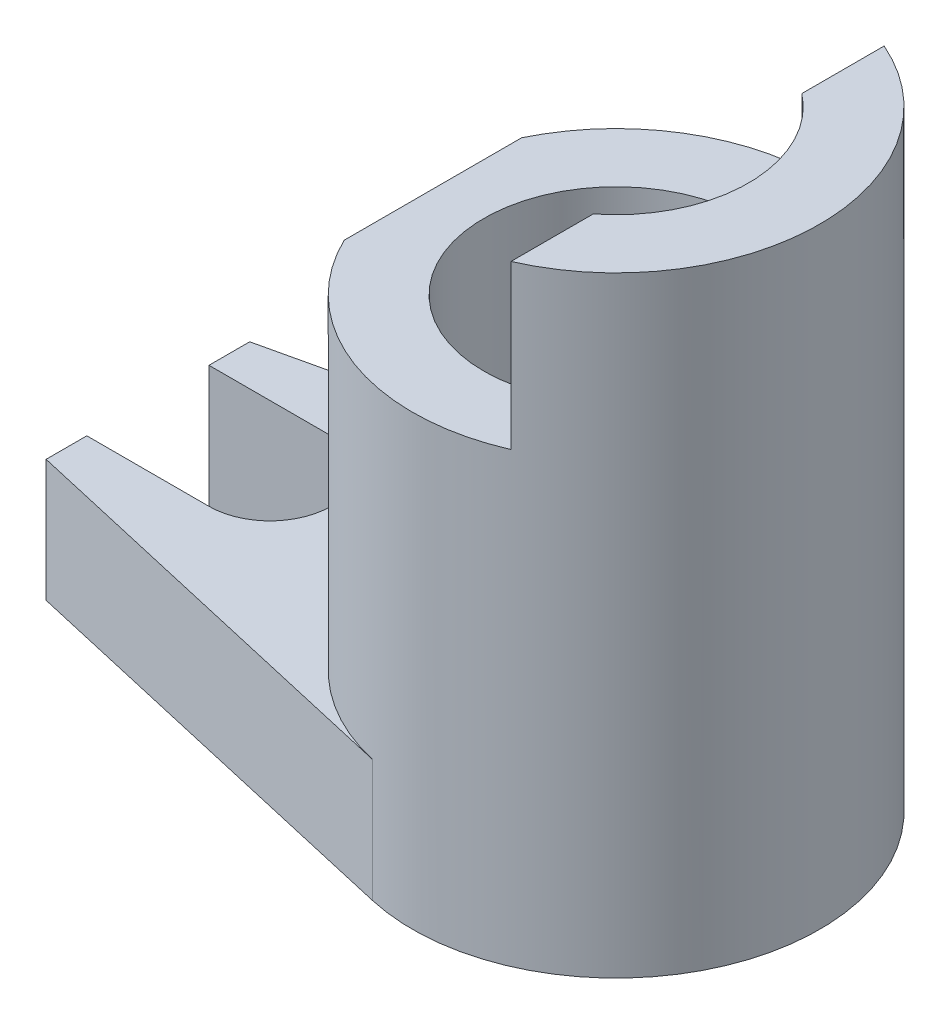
ISO-10303-21;
HEADER;
FILE_DESCRIPTION(('STEP AP214'),'2;1');
FILE_NAME('part.step','',(''),(''),'','','');
FILE_SCHEMA(('AUTOMOTIVE_DESIGN { 1 0 10303 214 1 1 1 1 }'));
ENDSEC;
DATA;
#1=APPLICATION_CONTEXT('core data for automotive mechanical design processes');
#2=APPLICATION_PROTOCOL_DEFINITION('international standard','automotive_design',2000,#1);
#3=PRODUCT_CONTEXT('',#1,'mechanical');
#4=PRODUCT('Part','Part','',(#3));
#5=PRODUCT_RELATED_PRODUCT_CATEGORY('part','',(#4));
#6=PRODUCT_DEFINITION_FORMATION('','',#4);
#7=PRODUCT_DEFINITION_CONTEXT('part definition',#1,'design');
#8=PRODUCT_DEFINITION('design','',#6,#7);
#9=PRODUCT_DEFINITION_SHAPE('','',#8);
#10=(LENGTH_UNIT() NAMED_UNIT(*) SI_UNIT(.MILLI.,.METRE.));
#11=(NAMED_UNIT(*) PLANE_ANGLE_UNIT() SI_UNIT($,.RADIAN.));
#12=(NAMED_UNIT(*) SI_UNIT($,.STERADIAN.) SOLID_ANGLE_UNIT());
#13=UNCERTAINTY_MEASURE_WITH_UNIT(LENGTH_MEASURE(1.E-05),#10,'distance_accuracy_value','');
#14=(GEOMETRIC_REPRESENTATION_CONTEXT(3) GLOBAL_UNCERTAINTY_ASSIGNED_CONTEXT((#13)) GLOBAL_UNIT_ASSIGNED_CONTEXT((#10,
#11,#12)) REPRESENTATION_CONTEXT('',''));
#15=CARTESIAN_POINT('',(0.,0.,0.));
#16=DIRECTION('',(0.,0.,1.));
#17=DIRECTION('',(1.,0.,0.));
#18=AXIS2_PLACEMENT_3D('',#15,#16,#17);
#19=CARTESIAN_POINT('',(-115.,30.,-25.));
#20=DIRECTION('',(1.,0.,0.));
#21=DIRECTION('',(0.,0.,-1.));
#22=AXIS2_PLACEMENT_3D('',#19,#20,#21);
#23=PLANE('',#22);
#24=DIRECTION('',(0.,0.,1.));
#25=VECTOR('',#24,1.);
#26=CARTESIAN_POINT('',(-115.,0.,-25.));
#27=LINE('',#26,#25);
#28=CARTESIAN_POINT('',(-115.,0.,-25.));
#29=VERTEX_POINT('',#28);
#30=CARTESIAN_POINT('',(-115.,0.,-15.));
#31=VERTEX_POINT('',#30);
#32=EDGE_CURVE('E281',#29,#31,#27,.T.);
#33=ORIENTED_EDGE('',*,*,#32,.T.);
#34=DIRECTION('',(0.,1.,0.));
#35=VECTOR('',#34,1.);
#36=CARTESIAN_POINT('',(-115.,0.,-15.));
#37=LINE('',#36,#35);
#38=CARTESIAN_POINT('',(-115.,30.,-15.));
#39=VERTEX_POINT('',#38);
#40=EDGE_CURVE('E278',#31,#39,#37,.T.);
#41=ORIENTED_EDGE('',*,*,#40,.T.);
#42=DIRECTION('',(0.,0.,1.));
#43=VECTOR('',#42,1.);
#44=CARTESIAN_POINT('',(-115.,30.,-25.));
#45=LINE('',#44,#43);
#46=CARTESIAN_POINT('',(-115.,30.,-25.));
#47=VERTEX_POINT('',#46);
#48=EDGE_CURVE('E195',#47,#39,#45,.T.);
#49=ORIENTED_EDGE('',*,*,#48,.F.);
#50=DIRECTION('',(0.,-1.,0.));
#51=VECTOR('',#50,1.);
#52=CARTESIAN_POINT('',(-115.,30.,-25.));
#53=LINE('',#52,#51);
#54=EDGE_CURVE('E178',#47,#29,#53,.T.);
#55=ORIENTED_EDGE('',*,*,#54,.T.);
#56=EDGE_LOOP('',(#33,#41,#49,#55));
#57=FACE_BOUND('',#56,.T.);
#58=ADVANCED_FACE('F31',(#57),#23,.F.);
#59=CARTESIAN_POINT('',(0.,30.,0.));
#60=DIRECTION('',(0.,-1.,0.));
#61=DIRECTION('',(0.,0.,-1.));
#62=AXIS2_PLACEMENT_3D('',#59,#60,#61);
#63=CYLINDRICAL_SURFACE('',#62,50.);
#64=CARTESIAN_POINT('',(0.,110.,0.));
#65=DIRECTION('',(0.,1.,0.));
#66=DIRECTION('',(0.,0.,1.));
#67=AXIS2_PLACEMENT_3D('',#64,#65,#66);
#68=CIRCLE('',#67,50.);
#69=CARTESIAN_POINT('',(-45.,110.,21.7944947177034));
#70=VERTEX_POINT('',#69);
#71=CARTESIAN_POINT('',(20.,110.,45.8257569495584));
#72=VERTEX_POINT('',#71);
#73=EDGE_CURVE('E149',#70,#72,#68,.T.);
#74=ORIENTED_EDGE('',*,*,#73,.F.);
#75=DIRECTION('',(0.,-1.,0.));
#76=VECTOR('',#75,1.);
#77=CARTESIAN_POINT('',(-45.,30.,21.7944947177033));
#78=LINE('',#77,#76);
#79=CARTESIAN_POINT('',(-45.,70.,21.7944947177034));
#80=VERTEX_POINT('',#79);
#81=EDGE_CURVE('E46',#70,#80,#78,.T.);
#82=ORIENTED_EDGE('',*,*,#81,.T.);
#83=CARTESIAN_POINT('',(0.,70.,0.));
#84=DIRECTION('',(0.,1.,0.));
#85=DIRECTION('',(0.,0.,1.));
#86=AXIS2_PLACEMENT_3D('',#83,#84,#85);
#87=CIRCLE('',#86,50.);
#88=CARTESIAN_POINT('',(-45.,70.,-21.7944947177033));
#89=VERTEX_POINT('',#88);
#90=EDGE_CURVE('E11',#89,#80,#87,.T.);
#91=ORIENTED_EDGE('',*,*,#90,.F.);
#92=DIRECTION('',(0.,-1.,0.));
#93=VECTOR('',#92,1.);
#94=CARTESIAN_POINT('',(-45.,30.,-21.7944947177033));
#95=LINE('',#94,#93);
#96=CARTESIAN_POINT('',(-45.,110.,-21.7944947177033));
#97=VERTEX_POINT('',#96);
#98=EDGE_CURVE('E131',#89,#97,#95,.F.);
#99=ORIENTED_EDGE('',*,*,#98,.T.);
#100=CARTESIAN_POINT('',(20.,110.,-45.8257569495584));
#101=VERTEX_POINT('',#100);
#102=EDGE_CURVE('E141',#101,#97,#68,.T.);
#103=ORIENTED_EDGE('',*,*,#102,.F.);
#104=DIRECTION('',(0.,-1.,0.));
#105=VECTOR('',#104,1.);
#106=CARTESIAN_POINT('',(20.,30.,-45.8257569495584));
#107=LINE('',#106,#105);
#108=CARTESIAN_POINT('',(20.,150.,-45.8257569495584));
#109=VERTEX_POINT('',#108);
#110=EDGE_CURVE('E148',#101,#109,#107,.F.);
#111=ORIENTED_EDGE('',*,*,#110,.T.);
#112=CARTESIAN_POINT('',(0.,150.,0.));
#113=DIRECTION('',(0.,1.,0.));
#114=DIRECTION('',(0.,0.,1.));
#115=AXIS2_PLACEMENT_3D('',#112,#113,#114);
#116=CIRCLE('',#115,50.);
#117=CARTESIAN_POINT('',(20.,150.,45.8257569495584));
#118=VERTEX_POINT('',#117);
#119=EDGE_CURVE('E166',#118,#109,#116,.T.);
#120=ORIENTED_EDGE('',*,*,#119,.F.);
#121=DIRECTION('',(0.,-1.,0.));
#122=VECTOR('',#121,1.);
#123=CARTESIAN_POINT('',(20.,30.,45.8257569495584));
#124=LINE('',#123,#122);
#125=EDGE_CURVE('E151',#118,#72,#124,.T.);
#126=ORIENTED_EDGE('',*,*,#125,.T.);
#127=EDGE_LOOP('',(#74,#82,#91,#99,#103,#111,#120,#126));
#128=FACE_BOUND('',#127,.T.);
#129=CARTESIAN_POINT('',(0.,0.,0.));
#130=DIRECTION('',(0.,1.,0.));
#131=DIRECTION('',(0.,0.,1.));
#132=AXIS2_PLACEMENT_3D('',#129,#130,#131);
#133=CIRCLE('',#132,50.);
#134=CARTESIAN_POINT('',(-11.1429261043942,0.,48.7425399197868));
#135=VERTEX_POINT('',#134);
#136=CARTESIAN_POINT('',(-11.1429261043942,0.,-48.7425399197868));
#137=VERTEX_POINT('',#136);
#138=EDGE_CURVE('E274',#135,#137,#133,.T.);
#139=ORIENTED_EDGE('',*,*,#138,.T.);
#140=DIRECTION('',(0.,-1.,0.));
#141=VECTOR('',#140,1.);
#142=CARTESIAN_POINT('',(-11.1429261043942,30.,-48.7425399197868));
#143=LINE('',#142,#141);
#144=CARTESIAN_POINT('',(-11.1429261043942,30.,-48.7425399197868));
#145=VERTEX_POINT('',#144);
#146=EDGE_CURVE('E180',#145,#137,#143,.T.);
#147=ORIENTED_EDGE('',*,*,#146,.F.);
#148=CARTESIAN_POINT('',(0.,30.,0.));
#149=DIRECTION('',(0.,1.,0.));
#150=DIRECTION('',(0.,0.,1.));
#151=AXIS2_PLACEMENT_3D('',#148,#149,#150);
#152=CIRCLE('',#151,50.);
#153=CARTESIAN_POINT('',(-11.1429261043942,30.,48.7425399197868));
#154=VERTEX_POINT('',#153);
#155=EDGE_CURVE('E163',#145,#154,#152,.T.);
#156=ORIENTED_EDGE('',*,*,#155,.T.);
#157=DIRECTION('',(0.,-1.,0.));
#158=VECTOR('',#157,1.);
#159=CARTESIAN_POINT('',(-11.1429261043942,30.,48.7425399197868));
#160=LINE('',#159,#158);
#161=EDGE_CURVE('E194',#154,#135,#160,.T.);
#162=ORIENTED_EDGE('',*,*,#161,.T.);
#163=EDGE_LOOP('',(#139,#147,#156,#162));
#164=FACE_BOUND('',#163,.T.);
#165=ADVANCED_FACE('F33',(#128,#164),#63,.T.);
#166=CARTESIAN_POINT('',(-11.1429261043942,30.,-48.7425399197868));
#167=DIRECTION('',(0.222858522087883,0.,0.974850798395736));
#168=DIRECTION('',(0.974850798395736,0.,-0.222858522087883));
#169=AXIS2_PLACEMENT_3D('',#166,#167,#168);
#170=PLANE('',#169);
#171=DIRECTION('',(-0.974850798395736,0.,0.222858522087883));
#172=VECTOR('',#171,1.);
#173=CARTESIAN_POINT('',(-11.1429261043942,0.,-48.7425399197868));
#174=LINE('',#173,#172);
#175=EDGE_CURVE('E277',#137,#29,#174,.T.);
#176=ORIENTED_EDGE('',*,*,#175,.T.);
#177=ORIENTED_EDGE('',*,*,#54,.F.);
#178=DIRECTION('',(-0.974850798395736,0.,0.222858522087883));
#179=VECTOR('',#178,1.);
#180=CARTESIAN_POINT('',(-11.1429261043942,30.,-48.7425399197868));
#181=LINE('',#180,#179);
#182=EDGE_CURVE('E186',#145,#47,#181,.T.);
#183=ORIENTED_EDGE('',*,*,#182,.F.);
#184=ORIENTED_EDGE('',*,*,#146,.T.);
#185=EDGE_LOOP('',(#176,#177,#183,#184));
#186=FACE_BOUND('',#185,.T.);
#187=ADVANCED_FACE('F247',(#186),#170,.F.);
#188=CARTESIAN_POINT('',(-115.,30.,15.));
#189=VERTEX_POINT('',#188);
#190=CARTESIAN_POINT('',(-115.,30.,25.));
#191=VERTEX_POINT('',#190);
#192=EDGE_CURVE('E188',#189,#191,#45,.T.);
#193=ORIENTED_EDGE('',*,*,#192,.F.);
#194=DIRECTION('',(0.,1.,0.));
#195=VECTOR('',#194,1.);
#196=CARTESIAN_POINT('',(-115.,0.,15.));
#197=LINE('',#196,#195);
#198=CARTESIAN_POINT('',(-115.,0.,15.));
#199=VERTEX_POINT('',#198);
#200=EDGE_CURVE('E263',#199,#189,#197,.T.);
#201=ORIENTED_EDGE('',*,*,#200,.F.);
#202=CARTESIAN_POINT('',(-115.,0.,25.));
#203=VERTEX_POINT('',#202);
#204=EDGE_CURVE('E280',#199,#203,#27,.T.);
#205=ORIENTED_EDGE('',*,*,#204,.T.);
#206=DIRECTION('',(0.,-1.,0.));
#207=VECTOR('',#206,1.);
#208=CARTESIAN_POINT('',(-115.,30.,25.));
#209=LINE('',#208,#207);
#210=EDGE_CURVE('E200',#191,#203,#209,.T.);
#211=ORIENTED_EDGE('',*,*,#210,.F.);
#212=EDGE_LOOP('',(#193,#201,#205,#211));
#213=FACE_BOUND('',#212,.T.);
#214=ADVANCED_FACE('F243',(#213),#23,.F.);
#215=CARTESIAN_POINT('',(-115.,30.,25.));
#216=DIRECTION('',(0.222858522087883,0.,-0.974850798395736));
#217=DIRECTION('',(-0.974850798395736,0.,-0.222858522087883));
#218=AXIS2_PLACEMENT_3D('',#215,#216,#217);
#219=PLANE('',#218);
#220=DIRECTION('',(0.974850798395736,0.,0.222858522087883));
#221=VECTOR('',#220,1.);
#222=CARTESIAN_POINT('',(-115.,0.,25.));
#223=LINE('',#222,#221);
#224=EDGE_CURVE('E189',#203,#135,#223,.T.);
#225=ORIENTED_EDGE('',*,*,#224,.T.);
#226=ORIENTED_EDGE('',*,*,#161,.F.);
#227=DIRECTION('',(0.974850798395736,0.,0.222858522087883));
#228=VECTOR('',#227,1.);
#229=CARTESIAN_POINT('',(-115.,30.,25.));
#230=LINE('',#229,#228);
#231=EDGE_CURVE('E192',#191,#154,#230,.T.);
#232=ORIENTED_EDGE('',*,*,#231,.F.);
#233=ORIENTED_EDGE('',*,*,#210,.T.);
#234=EDGE_LOOP('',(#225,#226,#232,#233));
#235=FACE_BOUND('',#234,.T.);
#236=ADVANCED_FACE('F251',(#235),#219,.F.);
#237=CARTESIAN_POINT('',(0.,30.,0.));
#238=DIRECTION('',(0.,1.,0.));
#239=DIRECTION('',(0.,0.,1.));
#240=AXIS2_PLACEMENT_3D('',#237,#238,#239);
#241=PLANE('',#240);
#242=ORIENTED_EDGE('',*,*,#155,.F.);
#243=ORIENTED_EDGE('',*,*,#182,.T.);
#244=ORIENTED_EDGE('',*,*,#48,.T.);
#245=DIRECTION('',(-1.,0.,0.));
#246=VECTOR('',#245,1.);
#247=CARTESIAN_POINT('',(-115.,30.,-15.));
#248=LINE('',#247,#246);
#249=CARTESIAN_POINT('',(-85.,30.,-15.));
#250=VERTEX_POINT('',#249);
#251=EDGE_CURVE('E308',#250,#39,#248,.T.);
#252=ORIENTED_EDGE('',*,*,#251,.F.);
#253=CARTESIAN_POINT('',(-85.,30.,0.));
#254=DIRECTION('',(0.,1.,0.));
#255=DIRECTION('',(0.,0.,1.));
#256=AXIS2_PLACEMENT_3D('',#253,#254,#255);
#257=CIRCLE('',#256,15.);
#258=CARTESIAN_POINT('',(-85.,30.,15.));
#259=VERTEX_POINT('',#258);
#260=EDGE_CURVE('E305',#259,#250,#257,.T.);
#261=ORIENTED_EDGE('',*,*,#260,.F.);
#262=DIRECTION('',(1.,0.,0.));
#263=VECTOR('',#262,1.);
#264=CARTESIAN_POINT('',(-115.,30.,15.));
#265=LINE('',#264,#263);
#266=EDGE_CURVE('E169',#189,#259,#265,.T.);
#267=ORIENTED_EDGE('',*,*,#266,.F.);
#268=ORIENTED_EDGE('',*,*,#192,.T.);
#269=ORIENTED_EDGE('',*,*,#231,.T.);
#270=EDGE_LOOP('',(#242,#243,#244,#252,#261,#267,#268,#269));
#271=FACE_BOUND('',#270,.T.);
#272=ADVANCED_FACE('F257',(#271),#241,.T.);
#273=CARTESIAN_POINT('',(0.,0.,0.));
#274=DIRECTION('',(0.,1.,0.));
#275=DIRECTION('',(0.,0.,1.));
#276=AXIS2_PLACEMENT_3D('',#273,#274,#275);
#277=PLANE('',#276);
#278=CARTESIAN_POINT('',(-85.,0.,0.));
#279=DIRECTION('',(0.,1.,0.));
#280=DIRECTION('',(0.,0.,1.));
#281=AXIS2_PLACEMENT_3D('',#278,#279,#280);
#282=CIRCLE('',#281,15.);
#283=CARTESIAN_POINT('',(-85.,0.,15.));
#284=VERTEX_POINT('',#283);
#285=CARTESIAN_POINT('',(-85.,0.,-15.));
#286=VERTEX_POINT('',#285);
#287=EDGE_CURVE('E298',#284,#286,#282,.T.);
#288=ORIENTED_EDGE('',*,*,#287,.T.);
#289=DIRECTION('',(-1.,0.,0.));
#290=VECTOR('',#289,1.);
#291=CARTESIAN_POINT('',(-115.,0.,-15.));
#292=LINE('',#291,#290);
#293=EDGE_CURVE('E296',#286,#31,#292,.T.);
#294=ORIENTED_EDGE('',*,*,#293,.T.);
#295=ORIENTED_EDGE('',*,*,#32,.F.);
#296=ORIENTED_EDGE('',*,*,#175,.F.);
#297=ORIENTED_EDGE('',*,*,#138,.F.);
#298=ORIENTED_EDGE('',*,*,#224,.F.);
#299=ORIENTED_EDGE('',*,*,#204,.F.);
#300=DIRECTION('',(1.,0.,0.));
#301=VECTOR('',#300,1.);
#302=CARTESIAN_POINT('',(-115.,0.,15.));
#303=LINE('',#302,#301);
#304=EDGE_CURVE('E173',#199,#284,#303,.T.);
#305=ORIENTED_EDGE('',*,*,#304,.T.);
#306=EDGE_LOOP('',(#288,#294,#295,#296,#297,#298,#299,#305));
#307=FACE_BOUND('',#306,.T.);
#308=ADVANCED_FACE('F293',(#307),#277,.F.);
#309=CARTESIAN_POINT('',(-115.,0.,-15.));
#310=DIRECTION('',(0.,0.,-1.));
#311=DIRECTION('',(-1.,0.,0.));
#312=AXIS2_PLACEMENT_3D('',#309,#310,#311);
#313=PLANE('',#312);
#314=ORIENTED_EDGE('',*,*,#251,.T.);
#315=ORIENTED_EDGE('',*,*,#40,.F.);
#316=ORIENTED_EDGE('',*,*,#293,.F.);
#317=DIRECTION('',(0.,1.,0.));
#318=VECTOR('',#317,1.);
#319=CARTESIAN_POINT('',(-85.,0.,-15.));
#320=LINE('',#319,#318);
#321=EDGE_CURVE('E311',#286,#250,#320,.T.);
#322=ORIENTED_EDGE('',*,*,#321,.T.);
#323=EDGE_LOOP('',(#314,#315,#316,#322));
#324=FACE_BOUND('',#323,.T.);
#325=ADVANCED_FACE('F317',(#324),#313,.F.);
#326=CARTESIAN_POINT('',(-85.,0.,0.));
#327=DIRECTION('',(0.,1.,0.));
#328=DIRECTION('',(0.,0.,1.));
#329=AXIS2_PLACEMENT_3D('',#326,#327,#328);
#330=CYLINDRICAL_SURFACE('',#329,15.);
#331=ORIENTED_EDGE('',*,*,#260,.T.);
#332=ORIENTED_EDGE('',*,*,#321,.F.);
#333=ORIENTED_EDGE('',*,*,#287,.F.);
#334=DIRECTION('',(0.,1.,0.));
#335=VECTOR('',#334,1.);
#336=CARTESIAN_POINT('',(-85.,0.,15.));
#337=LINE('',#336,#335);
#338=EDGE_CURVE('E301',#284,#259,#337,.T.);
#339=ORIENTED_EDGE('',*,*,#338,.T.);
#340=EDGE_LOOP('',(#331,#332,#333,#339));
#341=FACE_BOUND('',#340,.T.);
#342=ADVANCED_FACE('F236',(#341),#330,.F.);
#343=CARTESIAN_POINT('',(-115.,0.,15.));
#344=DIRECTION('',(0.,0.,1.));
#345=DIRECTION('',(1.,0.,0.));
#346=AXIS2_PLACEMENT_3D('',#343,#344,#345);
#347=PLANE('',#346);
#348=ORIENTED_EDGE('',*,*,#266,.T.);
#349=ORIENTED_EDGE('',*,*,#338,.F.);
#350=ORIENTED_EDGE('',*,*,#304,.F.);
#351=ORIENTED_EDGE('',*,*,#200,.T.);
#352=EDGE_LOOP('',(#348,#349,#350,#351));
#353=FACE_BOUND('',#352,.T.);
#354=ADVANCED_FACE('F228',(#353),#347,.F.);
#355=CARTESIAN_POINT('',(0.,150.,0.));
#356=DIRECTION('',(0.,1.,0.));
#357=DIRECTION('',(0.,0.,1.));
#358=AXIS2_PLACEMENT_3D('',#355,#356,#357);
#359=PLANE('',#358);
#360=DIRECTION('',(0.,0.,-1.));
#361=VECTOR('',#360,1.);
#362=CARTESIAN_POINT('',(20.,150.,-63.7452203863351));
#363=LINE('',#362,#361);
#364=CARTESIAN_POINT('',(20.,150.,25.617376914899));
#365=VERTEX_POINT('',#364);
#366=EDGE_CURVE('E211',#118,#365,#363,.T.);
#367=ORIENTED_EDGE('',*,*,#366,.F.);
#368=ORIENTED_EDGE('',*,*,#119,.T.);
#369=CARTESIAN_POINT('',(20.,150.,-25.617376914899));
#370=VERTEX_POINT('',#369);
#371=EDGE_CURVE('E154',#370,#109,#363,.T.);
#372=ORIENTED_EDGE('',*,*,#371,.F.);
#373=CARTESIAN_POINT('',(0.,150.,0.));
#374=DIRECTION('',(0.,1.,0.));
#375=DIRECTION('',(0.,0.,1.));
#376=AXIS2_PLACEMENT_3D('',#373,#374,#375);
#377=CIRCLE('',#376,32.5);
#378=EDGE_CURVE('E160',#365,#370,#377,.T.);
#379=ORIENTED_EDGE('',*,*,#378,.F.);
#380=EDGE_LOOP('',(#367,#368,#372,#379));
#381=FACE_BOUND('',#380,.T.);
#382=ADVANCED_FACE('F226',(#381),#359,.T.);
#383=CARTESIAN_POINT('',(0.,150.,0.));
#384=DIRECTION('',(0.,-1.,0.));
#385=DIRECTION('',(0.,0.,-1.));
#386=AXIS2_PLACEMENT_3D('',#383,#384,#385);
#387=CYLINDRICAL_SURFACE('',#386,32.5);
#388=DIRECTION('',(0.,-1.,0.));
#389=VECTOR('',#388,1.);
#390=CARTESIAN_POINT('',(20.,150.,25.617376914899));
#391=LINE('',#390,#389);
#392=CARTESIAN_POINT('',(20.,110.,25.617376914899));
#393=VERTEX_POINT('',#392);
#394=EDGE_CURVE('E135',#365,#393,#391,.T.);
#395=ORIENTED_EDGE('',*,*,#394,.F.);
#396=ORIENTED_EDGE('',*,*,#378,.T.);
#397=DIRECTION('',(0.,-1.,0.));
#398=VECTOR('',#397,1.);
#399=CARTESIAN_POINT('',(20.,150.,-25.617376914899));
#400=LINE('',#399,#398);
#401=CARTESIAN_POINT('',(20.,110.,-25.617376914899));
#402=VERTEX_POINT('',#401);
#403=EDGE_CURVE('E205',#402,#370,#400,.F.);
#404=ORIENTED_EDGE('',*,*,#403,.F.);
#405=CARTESIAN_POINT('',(0.,110.,0.));
#406=DIRECTION('',(0.,1.,0.));
#407=DIRECTION('',(0.,0.,1.));
#408=AXIS2_PLACEMENT_3D('',#405,#406,#407);
#409=CIRCLE('',#408,32.5);
#410=EDGE_CURVE('E183',#402,#393,#409,.T.);
#411=ORIENTED_EDGE('',*,*,#410,.T.);
#412=EDGE_LOOP('',(#395,#396,#404,#411));
#413=FACE_BOUND('',#412,.T.);
#414=CARTESIAN_POINT('',(0.,30.,0.));
#415=DIRECTION('',(0.,1.,0.));
#416=DIRECTION('',(0.,0.,1.));
#417=AXIS2_PLACEMENT_3D('',#414,#415,#416);
#418=CIRCLE('',#417,32.5);
#419=CARTESIAN_POINT('',(0.,30.,32.5));
#420=VERTEX_POINT('',#419);
#421=EDGE_CURVE('E159',#420,#420,#418,.T.);
#422=ORIENTED_EDGE('',*,*,#421,.F.);
#423=EDGE_LOOP('',(#422));
#424=FACE_BOUND('',#423,.T.);
#425=ADVANCED_FACE('F215',(#413,#424),#387,.F.);
#426=ORIENTED_EDGE('',*,*,#421,.T.);
#427=EDGE_LOOP('',(#426));
#428=FACE_BOUND('',#427,.T.);
#429=ADVANCED_FACE('F234',(#428),#241,.T.);
#430=CARTESIAN_POINT('',(20.,110.,-63.7452203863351));
#431=DIRECTION('',(1.,0.,0.));
#432=DIRECTION('',(0.,0.,-1.));
#433=AXIS2_PLACEMENT_3D('',#430,#431,#432);
#434=PLANE('',#433);
#435=ORIENTED_EDGE('',*,*,#366,.T.);
#436=ORIENTED_EDGE('',*,*,#394,.T.);
#437=DIRECTION('',(0.,0.,-1.));
#438=VECTOR('',#437,1.);
#439=CARTESIAN_POINT('',(20.,110.,-63.7452203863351));
#440=LINE('',#439,#438);
#441=EDGE_CURVE('E54',#72,#393,#440,.T.);
#442=ORIENTED_EDGE('',*,*,#441,.F.);
#443=ORIENTED_EDGE('',*,*,#125,.F.);
#444=EDGE_LOOP('',(#435,#436,#442,#443));
#445=FACE_BOUND('',#444,.T.);
#446=ADVANCED_FACE('F209',(#445),#434,.F.);
#447=EDGE_CURVE('E147',#402,#101,#440,.T.);
#448=ORIENTED_EDGE('',*,*,#447,.F.);
#449=ORIENTED_EDGE('',*,*,#403,.T.);
#450=ORIENTED_EDGE('',*,*,#371,.T.);
#451=ORIENTED_EDGE('',*,*,#110,.F.);
#452=EDGE_LOOP('',(#448,#449,#450,#451));
#453=FACE_BOUND('',#452,.T.);
#454=ADVANCED_FACE('F218',(#453),#434,.F.);
#455=CARTESIAN_POINT('',(-70.086220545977,110.,62.428170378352));
#456=DIRECTION('',(0.,1.,0.));
#457=DIRECTION('',(0.,0.,1.));
#458=AXIS2_PLACEMENT_3D('',#455,#456,#457);
#459=PLANE('',#458);
#460=DIRECTION('',(0.,0.,-1.));
#461=VECTOR('',#460,1.);
#462=CARTESIAN_POINT('',(-45.,110.,62.428170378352));
#463=LINE('',#462,#461);
#464=EDGE_CURVE('E39',#70,#97,#463,.T.);
#465=ORIENTED_EDGE('',*,*,#464,.F.);
#466=ORIENTED_EDGE('',*,*,#73,.T.);
#467=ORIENTED_EDGE('',*,*,#441,.T.);
#468=ORIENTED_EDGE('',*,*,#410,.F.);
#469=ORIENTED_EDGE('',*,*,#447,.T.);
#470=ORIENTED_EDGE('',*,*,#102,.T.);
#471=EDGE_LOOP('',(#465,#466,#467,#468,#469,#470));
#472=FACE_BOUND('',#471,.T.);
#473=ADVANCED_FACE('F145',(#472),#459,.T.);
#474=CARTESIAN_POINT('',(-62.6484701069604,70.,29.2385101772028));
#475=DIRECTION('',(0.,1.,0.));
#476=DIRECTION('',(0.,0.,1.));
#477=AXIS2_PLACEMENT_3D('',#474,#475,#476);
#478=PLANE('',#477);
#479=ORIENTED_EDGE('',*,*,#90,.T.);
#480=DIRECTION('',(0.,0.,-1.));
#481=VECTOR('',#480,1.);
#482=CARTESIAN_POINT('',(-45.,70.,-25.0239501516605));
#483=LINE('',#482,#481);
#484=EDGE_CURVE('E142',#80,#89,#483,.T.);
#485=ORIENTED_EDGE('',*,*,#484,.T.);
#486=EDGE_LOOP('',(#479,#485));
#487=FACE_BOUND('',#486,.T.);
#488=ADVANCED_FACE('F223',(#487),#478,.T.);
#489=CARTESIAN_POINT('',(-45.,70.,-25.0239501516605));
#490=DIRECTION('',(1.,0.,0.));
#491=DIRECTION('',(0.,0.,-1.));
#492=AXIS2_PLACEMENT_3D('',#489,#490,#491);
#493=PLANE('',#492);
#494=ORIENTED_EDGE('',*,*,#464,.T.);
#495=ORIENTED_EDGE('',*,*,#98,.F.);
#496=ORIENTED_EDGE('',*,*,#484,.F.);
#497=ORIENTED_EDGE('',*,*,#81,.F.);
#498=EDGE_LOOP('',(#494,#495,#496,#497));
#499=FACE_BOUND('',#498,.T.);
#500=ADVANCED_FACE('F130',(#499),#493,.F.);
#501=CLOSED_SHELL('',(#58,#165,#187,#214,#236,#272,#308,#325,#342,#354,#382,#425,#429,#446,#454,
#473,#488,#500));
#502=MANIFOLD_SOLID_BREP('B2',#501);
#503=ADVANCED_BREP_SHAPE_REPRESENTATION('',(#18,#502),#14);
#504=SHAPE_DEFINITION_REPRESENTATION(#9,#503);
ENDSEC;
END-ISO-10303-21;
